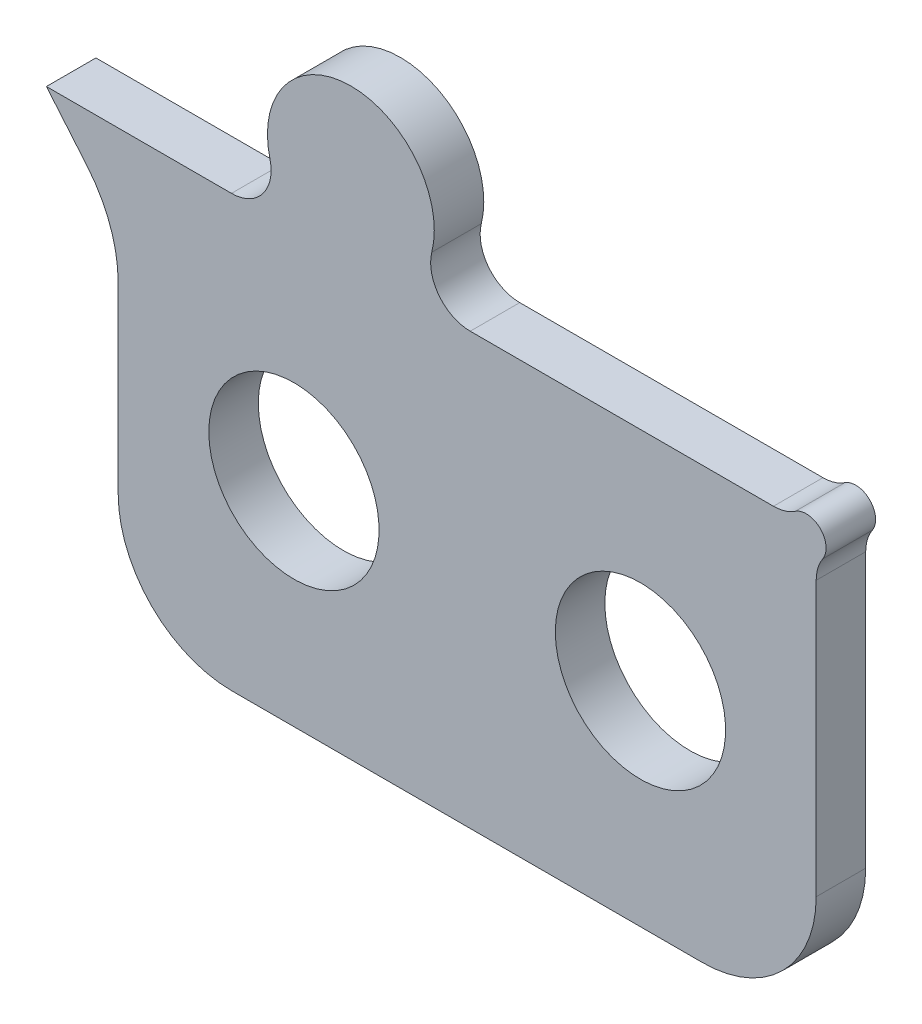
ISO-10303-21;
HEADER;
FILE_DESCRIPTION(('STEP AP214'),'2;1');
FILE_NAME('part.step','',(''),(''),'','','');
FILE_SCHEMA(('AUTOMOTIVE_DESIGN { 1 0 10303 214 1 1 1 1 }'));
ENDSEC;
DATA;
#1=APPLICATION_CONTEXT('core data for automotive mechanical design processes');
#2=APPLICATION_PROTOCOL_DEFINITION('international standard','automotive_design',2000,#1);
#3=PRODUCT_CONTEXT('',#1,'mechanical');
#4=PRODUCT('Part','Part','',(#3));
#5=PRODUCT_RELATED_PRODUCT_CATEGORY('part','',(#4));
#6=PRODUCT_DEFINITION_FORMATION('','',#4);
#7=PRODUCT_DEFINITION_CONTEXT('part definition',#1,'design');
#8=PRODUCT_DEFINITION('design','',#6,#7);
#9=PRODUCT_DEFINITION_SHAPE('','',#8);
#10=(LENGTH_UNIT() NAMED_UNIT(*) SI_UNIT(.MILLI.,.METRE.));
#11=(NAMED_UNIT(*) PLANE_ANGLE_UNIT() SI_UNIT($,.RADIAN.));
#12=(NAMED_UNIT(*) SI_UNIT($,.STERADIAN.) SOLID_ANGLE_UNIT());
#13=UNCERTAINTY_MEASURE_WITH_UNIT(LENGTH_MEASURE(1.E-05),#10,'distance_accuracy_value','');
#14=(GEOMETRIC_REPRESENTATION_CONTEXT(3) GLOBAL_UNCERTAINTY_ASSIGNED_CONTEXT((#13)) GLOBAL_UNIT_ASSIGNED_CONTEXT((#10,
#11,#12)) REPRESENTATION_CONTEXT('',''));
#15=CARTESIAN_POINT('',(0.,0.,0.));
#16=DIRECTION('',(0.,0.,1.));
#17=DIRECTION('',(1.,0.,0.));
#18=AXIS2_PLACEMENT_3D('',#15,#16,#17);
#19=CARTESIAN_POINT('',(-162.306,-88.8003363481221,0.));
#20=DIRECTION('',(0.,0.,1.));
#21=DIRECTION('',(1.,0.,0.));
#22=AXIS2_PLACEMENT_3D('',#19,#20,#21);
#23=PLANE('',#22);
#24=CARTESIAN_POINT('',(-146.431,-93.091,0.));
#25=DIRECTION('',(0.,0.,-1.));
#26=DIRECTION('',(-1.,0.,0.));
#27=AXIS2_PLACEMENT_3D('',#24,#25,#26);
#28=CIRCLE('',#27,4.36880000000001);
#29=CARTESIAN_POINT('',(-150.7998,-93.091,0.));
#30=VERTEX_POINT('',#29);
#31=EDGE_CURVE('E360',#30,#30,#28,.T.);
#32=ORIENTED_EDGE('',*,*,#31,.F.);
#33=EDGE_LOOP('',(#32));
#34=FACE_BOUND('',#33,.T.);
#35=DIRECTION('',(0.642787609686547,-0.766044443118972,0.));
#36=VECTOR('',#35,1.);
#37=CARTESIAN_POINT('',(-159.131,-81.915,0.));
#38=LINE('',#37,#36);
#39=CARTESIAN_POINT('',(-159.131,-81.915,0.));
#40=VERTEX_POINT('',#39);
#41=CARTESIAN_POINT('',(-157.05246720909,-84.3920989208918,0.));
#42=VERTEX_POINT('',#41);
#43=EDGE_CURVE('E190',#40,#42,#38,.T.);
#44=ORIENTED_EDGE('',*,*,#43,.F.);
#45=DIRECTION('',(-1.,0.,0.));
#46=VECTOR('',#45,1.);
#47=CARTESIAN_POINT('',(-149.63515351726,-81.915,0.));
#48=LINE('',#47,#46);
#49=CARTESIAN_POINT('',(-149.63515351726,-81.915,0.));
#50=VERTEX_POINT('',#49);
#51=EDGE_CURVE('E119',#50,#40,#48,.T.);
#52=ORIENTED_EDGE('',*,*,#51,.F.);
#53=CARTESIAN_POINT('',(-149.63515351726,-79.883,0.));
#54=DIRECTION('',(0.,0.,-1.));
#55=DIRECTION('',(1.,0.,0.));
#56=AXIS2_PLACEMENT_3D('',#53,#54,#55);
#57=CIRCLE('',#56,2.032);
#58=CARTESIAN_POINT('',(-147.663273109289,-79.3923762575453,0.));
#59=VERTEX_POINT('',#58);
#60=EDGE_CURVE('E113',#59,#50,#57,.T.);
#61=ORIENTED_EDGE('',*,*,#60,.F.);
#62=CARTESIAN_POINT('',(-143.51,-78.359,0.));
#63=DIRECTION('',(0.,0.,1.));
#64=DIRECTION('',(1.,0.,0.));
#65=AXIS2_PLACEMENT_3D('',#62,#63,#64);
#66=CIRCLE('',#65,4.27989999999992);
#67=CARTESIAN_POINT('',(-139.356726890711,-79.3923762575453,0.));
#68=VERTEX_POINT('',#67);
#69=EDGE_CURVE('E176',#68,#59,#66,.T.);
#70=ORIENTED_EDGE('',*,*,#69,.F.);
#71=CARTESIAN_POINT('',(-137.38484648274,-79.883,0.));
#72=DIRECTION('',(0.,0.,-1.));
#73=DIRECTION('',(1.,0.,0.));
#74=AXIS2_PLACEMENT_3D('',#71,#72,#73);
#75=CIRCLE('',#74,2.03200000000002);
#76=CARTESIAN_POINT('',(-137.38484648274,-81.915,0.));
#77=VERTEX_POINT('',#76);
#78=EDGE_CURVE('E225',#77,#68,#75,.T.);
#79=ORIENTED_EDGE('',*,*,#78,.F.);
#80=DIRECTION('',(-1.,0.,0.));
#81=VECTOR('',#80,1.);
#82=CARTESIAN_POINT('',(-121.826845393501,-81.915,0.));
#83=LINE('',#82,#81);
#84=CARTESIAN_POINT('',(-121.826845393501,-81.915,0.));
#85=VERTEX_POINT('',#84);
#86=EDGE_CURVE('E222',#85,#77,#83,.T.);
#87=ORIENTED_EDGE('',*,*,#86,.F.);
#88=CARTESIAN_POINT('',(-121.826845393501,-79.883,0.));
#89=DIRECTION('',(0.,0.,-1.));
#90=DIRECTION('',(1.,0.,0.));
#91=AXIS2_PLACEMENT_3D('',#88,#89,#90);
#92=CIRCLE('',#91,2.032);
#93=CARTESIAN_POINT('',(-120.703615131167,-81.5763333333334,0.));
#94=VERTEX_POINT('',#93);
#95=EDGE_CURVE('E219',#94,#85,#92,.T.);
#96=ORIENTED_EDGE('',*,*,#95,.F.);
#97=CARTESIAN_POINT('',(-120.142,-82.423,0.));
#98=DIRECTION('',(0.,0.,1.));
#99=DIRECTION('',(1.,0.,0.));
#100=AXIS2_PLACEMENT_3D('',#97,#98,#99);
#101=CIRCLE('',#100,1.01599999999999);
#102=CARTESIAN_POINT('',(-119.295333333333,-82.9846151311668,0.));
#103=VERTEX_POINT('',#102);
#104=EDGE_CURVE('E216',#103,#94,#101,.T.);
#105=ORIENTED_EDGE('',*,*,#104,.F.);
#106=CARTESIAN_POINT('',(-117.602,-84.1078453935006,0.));
#107=DIRECTION('',(0.,0.,-1.));
#108=DIRECTION('',(1.,0.,0.));
#109=AXIS2_PLACEMENT_3D('',#106,#107,#108);
#110=CIRCLE('',#109,2.032);
#111=CARTESIAN_POINT('',(-119.634,-84.1078453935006,0.));
#112=VERTEX_POINT('',#111);
#113=EDGE_CURVE('E213',#112,#103,#110,.T.);
#114=ORIENTED_EDGE('',*,*,#113,.F.);
#115=DIRECTION('',(0.,1.,0.));
#116=VECTOR('',#115,1.);
#117=CARTESIAN_POINT('',(-119.634,-98.171,0.));
#118=LINE('',#117,#116);
#119=CARTESIAN_POINT('',(-119.634,-98.171,0.));
#120=VERTEX_POINT('',#119);
#121=EDGE_CURVE('E210',#120,#112,#118,.T.);
#122=ORIENTED_EDGE('',*,*,#121,.F.);
#123=CARTESIAN_POINT('',(-125.476,-98.171,0.));
#124=DIRECTION('',(0.,0.,1.));
#125=DIRECTION('',(1.,0.,0.));
#126=AXIS2_PLACEMENT_3D('',#123,#124,#125);
#127=CIRCLE('',#126,5.84199999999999);
#128=CARTESIAN_POINT('',(-125.476,-104.013,0.));
#129=VERTEX_POINT('',#128);
#130=EDGE_CURVE('E207',#129,#120,#127,.T.);
#131=ORIENTED_EDGE('',*,*,#130,.F.);
#132=DIRECTION('',(1.,0.,0.));
#133=VECTOR('',#132,1.);
#134=CARTESIAN_POINT('',(-149.606,-104.013,0.));
#135=LINE('',#134,#133);
#136=CARTESIAN_POINT('',(-149.606,-104.013,0.));
#137=VERTEX_POINT('',#136);
#138=EDGE_CURVE('E204',#137,#129,#135,.T.);
#139=ORIENTED_EDGE('',*,*,#138,.F.);
#140=CARTESIAN_POINT('',(-149.606,-98.171,0.));
#141=DIRECTION('',(0.,0.,1.));
#142=DIRECTION('',(1.,0.,0.));
#143=AXIS2_PLACEMENT_3D('',#140,#141,#142);
#144=CIRCLE('',#143,5.84199999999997);
#145=CARTESIAN_POINT('',(-155.448,-98.171,0.));
#146=VERTEX_POINT('',#145);
#147=EDGE_CURVE('E201',#146,#137,#144,.T.);
#148=ORIENTED_EDGE('',*,*,#147,.F.);
#149=DIRECTION('',(0.,-1.,0.));
#150=VECTOR('',#149,1.);
#151=CARTESIAN_POINT('',(-155.448,-88.8003363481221,0.));
#152=LINE('',#151,#150);
#153=CARTESIAN_POINT('',(-155.448,-88.8003363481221,0.));
#154=VERTEX_POINT('',#153);
#155=EDGE_CURVE('E198',#154,#146,#152,.T.);
#156=ORIENTED_EDGE('',*,*,#155,.F.);
#157=CARTESIAN_POINT('',(-162.306,-88.8003363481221,0.));
#158=DIRECTION('',(0.,0.,-1.));
#159=DIRECTION('',(1.,0.,0.));
#160=AXIS2_PLACEMENT_3D('',#157,#158,#159);
#161=CIRCLE('',#160,6.85800000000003);
#162=EDGE_CURVE('E194',#42,#154,#161,.T.);
#163=ORIENTED_EDGE('',*,*,#162,.F.);
#164=EDGE_LOOP('',(#44,#52,#61,#70,#79,#87,#96,#105,#114,#122,#131,#139,#148,#156,#163));
#165=FACE_BOUND('',#164,.T.);
#166=CARTESIAN_POINT('',(-128.651,-93.091,0.));
#167=DIRECTION('',(0.,0.,-1.));
#168=DIRECTION('',(-1.,0.,0.));
#169=AXIS2_PLACEMENT_3D('',#166,#167,#168);
#170=CIRCLE('',#169,4.36879999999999);
#171=CARTESIAN_POINT('',(-133.0198,-93.091,0.));
#172=VERTEX_POINT('',#171);
#173=EDGE_CURVE('E350',#172,#172,#170,.T.);
#174=ORIENTED_EDGE('',*,*,#173,.F.);
#175=EDGE_LOOP('',(#174));
#176=FACE_BOUND('',#175,.T.);
#177=ADVANCED_FACE('F45',(#34,#165,#176),#23,.F.);
#178=CARTESIAN_POINT('',(-159.131,-81.915,2.54));
#179=DIRECTION('',(0.766044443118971,0.642787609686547,0.));
#180=DIRECTION('',(-0.642787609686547,0.766044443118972,0.));
#181=AXIS2_PLACEMENT_3D('',#178,#179,#180);
#182=PLANE('',#181);
#183=ORIENTED_EDGE('',*,*,#43,.T.);
#184=DIRECTION('',(0.,0.,-1.));
#185=VECTOR('',#184,1.);
#186=CARTESIAN_POINT('',(-157.05246720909,-84.3920989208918,2.54));
#187=LINE('',#186,#185);
#188=CARTESIAN_POINT('',(-157.05246720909,-84.3920989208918,2.54));
#189=VERTEX_POINT('',#188);
#190=EDGE_CURVE('E11',#189,#42,#187,.T.);
#191=ORIENTED_EDGE('',*,*,#190,.F.);
#192=DIRECTION('',(0.642787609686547,-0.766044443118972,0.));
#193=VECTOR('',#192,1.);
#194=CARTESIAN_POINT('',(-159.131,-81.915,2.54));
#195=LINE('',#194,#193);
#196=CARTESIAN_POINT('',(-159.131,-81.915,2.54));
#197=VERTEX_POINT('',#196);
#198=EDGE_CURVE('E234',#197,#189,#195,.T.);
#199=ORIENTED_EDGE('',*,*,#198,.F.);
#200=DIRECTION('',(0.,0.,-1.));
#201=VECTOR('',#200,1.);
#202=CARTESIAN_POINT('',(-159.131,-81.915,2.54));
#203=LINE('',#202,#201);
#204=EDGE_CURVE('E186',#197,#40,#203,.T.);
#205=ORIENTED_EDGE('',*,*,#204,.T.);
#206=EDGE_LOOP('',(#183,#191,#199,#205));
#207=FACE_BOUND('',#206,.T.);
#208=ADVANCED_FACE('F47',(#207),#182,.F.);
#209=CARTESIAN_POINT('',(-162.306,-88.8003363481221,2.54));
#210=DIRECTION('',(0.,0.,-1.));
#211=DIRECTION('',(-1.,0.,0.));
#212=AXIS2_PLACEMENT_3D('',#209,#210,#211);
#213=CYLINDRICAL_SURFACE('',#212,6.85800000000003);
#214=ORIENTED_EDGE('',*,*,#162,.T.);
#215=DIRECTION('',(0.,0.,-1.));
#216=VECTOR('',#215,1.);
#217=CARTESIAN_POINT('',(-155.448,-88.8003363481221,2.54));
#218=LINE('',#217,#216);
#219=CARTESIAN_POINT('',(-155.448,-88.8003363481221,2.54));
#220=VERTEX_POINT('',#219);
#221=EDGE_CURVE('E55',#220,#154,#218,.T.);
#222=ORIENTED_EDGE('',*,*,#221,.F.);
#223=CARTESIAN_POINT('',(-162.306,-88.8003363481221,2.54));
#224=DIRECTION('',(0.,0.,-1.));
#225=DIRECTION('',(1.,0.,0.));
#226=AXIS2_PLACEMENT_3D('',#223,#224,#225);
#227=CIRCLE('',#226,6.85800000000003);
#228=EDGE_CURVE('E127',#189,#220,#227,.T.);
#229=ORIENTED_EDGE('',*,*,#228,.F.);
#230=ORIENTED_EDGE('',*,*,#190,.T.);
#231=EDGE_LOOP('',(#214,#222,#229,#230));
#232=FACE_BOUND('',#231,.T.);
#233=ADVANCED_FACE('F377',(#232),#213,.F.);
#234=CARTESIAN_POINT('',(-155.448,-88.8003363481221,2.54));
#235=DIRECTION('',(1.,0.,0.));
#236=DIRECTION('',(0.,0.,-1.));
#237=AXIS2_PLACEMENT_3D('',#234,#235,#236);
#238=PLANE('',#237);
#239=ORIENTED_EDGE('',*,*,#155,.T.);
#240=DIRECTION('',(0.,0.,-1.));
#241=VECTOR('',#240,1.);
#242=CARTESIAN_POINT('',(-155.448,-98.171,2.54));
#243=LINE('',#242,#241);
#244=CARTESIAN_POINT('',(-155.448,-98.171,2.54));
#245=VERTEX_POINT('',#244);
#246=EDGE_CURVE('E273',#245,#146,#243,.T.);
#247=ORIENTED_EDGE('',*,*,#246,.F.);
#248=DIRECTION('',(0.,-1.,0.));
#249=VECTOR('',#248,1.);
#250=CARTESIAN_POINT('',(-155.448,-88.8003363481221,2.54));
#251=LINE('',#250,#249);
#252=EDGE_CURVE('E284',#220,#245,#251,.T.);
#253=ORIENTED_EDGE('',*,*,#252,.F.);
#254=ORIENTED_EDGE('',*,*,#221,.T.);
#255=EDGE_LOOP('',(#239,#247,#253,#254));
#256=FACE_BOUND('',#255,.T.);
#257=ADVANCED_FACE('F282',(#256),#238,.F.);
#258=CARTESIAN_POINT('',(-149.606,-98.171,2.54));
#259=DIRECTION('',(0.,0.,-1.));
#260=DIRECTION('',(-1.,0.,0.));
#261=AXIS2_PLACEMENT_3D('',#258,#259,#260);
#262=CYLINDRICAL_SURFACE('',#261,5.84199999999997);
#263=ORIENTED_EDGE('',*,*,#147,.T.);
#264=DIRECTION('',(0.,0.,-1.));
#265=VECTOR('',#264,1.);
#266=CARTESIAN_POINT('',(-149.606,-104.013,2.54));
#267=LINE('',#266,#265);
#268=CARTESIAN_POINT('',(-149.606,-104.013,2.54));
#269=VERTEX_POINT('',#268);
#270=EDGE_CURVE('E269',#269,#137,#267,.T.);
#271=ORIENTED_EDGE('',*,*,#270,.F.);
#272=CARTESIAN_POINT('',(-149.606,-98.171,2.54));
#273=DIRECTION('',(0.,0.,1.));
#274=DIRECTION('',(1.,0.,0.));
#275=AXIS2_PLACEMENT_3D('',#272,#273,#274);
#276=CIRCLE('',#275,5.84199999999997);
#277=EDGE_CURVE('E303',#245,#269,#276,.T.);
#278=ORIENTED_EDGE('',*,*,#277,.F.);
#279=ORIENTED_EDGE('',*,*,#246,.T.);
#280=EDGE_LOOP('',(#263,#271,#278,#279));
#281=FACE_BOUND('',#280,.T.);
#282=ADVANCED_FACE('F293',(#281),#262,.T.);
#283=CARTESIAN_POINT('',(-149.606,-104.013,2.54));
#284=DIRECTION('',(0.,1.,0.));
#285=DIRECTION('',(-1.,0.,0.));
#286=AXIS2_PLACEMENT_3D('',#283,#284,#285);
#287=PLANE('',#286);
#288=ORIENTED_EDGE('',*,*,#138,.T.);
#289=DIRECTION('',(0.,0.,-1.));
#290=VECTOR('',#289,1.);
#291=CARTESIAN_POINT('',(-125.476,-104.013,2.54));
#292=LINE('',#291,#290);
#293=CARTESIAN_POINT('',(-125.476,-104.013,2.54));
#294=VERTEX_POINT('',#293);
#295=EDGE_CURVE('E265',#294,#129,#292,.T.);
#296=ORIENTED_EDGE('',*,*,#295,.F.);
#297=DIRECTION('',(1.,0.,0.));
#298=VECTOR('',#297,1.);
#299=CARTESIAN_POINT('',(-149.606,-104.013,2.54));
#300=LINE('',#299,#298);
#301=EDGE_CURVE('E299',#269,#294,#300,.T.);
#302=ORIENTED_EDGE('',*,*,#301,.F.);
#303=ORIENTED_EDGE('',*,*,#270,.T.);
#304=EDGE_LOOP('',(#288,#296,#302,#303));
#305=FACE_BOUND('',#304,.T.);
#306=ADVANCED_FACE('F297',(#305),#287,.F.);
#307=CARTESIAN_POINT('',(-125.476,-98.171,2.54));
#308=DIRECTION('',(0.,0.,-1.));
#309=DIRECTION('',(-1.,0.,0.));
#310=AXIS2_PLACEMENT_3D('',#307,#308,#309);
#311=CYLINDRICAL_SURFACE('',#310,5.84199999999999);
#312=ORIENTED_EDGE('',*,*,#130,.T.);
#313=DIRECTION('',(0.,0.,-1.));
#314=VECTOR('',#313,1.);
#315=CARTESIAN_POINT('',(-119.634,-98.171,2.54));
#316=LINE('',#315,#314);
#317=CARTESIAN_POINT('',(-119.634,-98.171,2.54));
#318=VERTEX_POINT('',#317);
#319=EDGE_CURVE('E261',#318,#120,#316,.T.);
#320=ORIENTED_EDGE('',*,*,#319,.F.);
#321=CARTESIAN_POINT('',(-125.476,-98.171,2.54));
#322=DIRECTION('',(0.,0.,1.));
#323=DIRECTION('',(1.,0.,0.));
#324=AXIS2_PLACEMENT_3D('',#321,#322,#323);
#325=CIRCLE('',#324,5.84199999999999);
#326=EDGE_CURVE('E302',#294,#318,#325,.T.);
#327=ORIENTED_EDGE('',*,*,#326,.F.);
#328=ORIENTED_EDGE('',*,*,#295,.T.);
#329=EDGE_LOOP('',(#312,#320,#327,#328));
#330=FACE_BOUND('',#329,.T.);
#331=ADVANCED_FACE('F422',(#330),#311,.T.);
#332=CARTESIAN_POINT('',(-119.634,-98.171,2.54));
#333=DIRECTION('',(-1.,0.,0.));
#334=DIRECTION('',(0.,0.,1.));
#335=AXIS2_PLACEMENT_3D('',#332,#333,#334);
#336=PLANE('',#335);
#337=ORIENTED_EDGE('',*,*,#121,.T.);
#338=DIRECTION('',(0.,0.,-1.));
#339=VECTOR('',#338,1.);
#340=CARTESIAN_POINT('',(-119.634,-84.1078453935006,2.54));
#341=LINE('',#340,#339);
#342=CARTESIAN_POINT('',(-119.634,-84.1078453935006,2.54));
#343=VERTEX_POINT('',#342);
#344=EDGE_CURVE('E257',#343,#112,#341,.T.);
#345=ORIENTED_EDGE('',*,*,#344,.F.);
#346=DIRECTION('',(0.,1.,0.));
#347=VECTOR('',#346,1.);
#348=CARTESIAN_POINT('',(-119.634,-98.171,2.54));
#349=LINE('',#348,#347);
#350=EDGE_CURVE('E308',#318,#343,#349,.T.);
#351=ORIENTED_EDGE('',*,*,#350,.F.);
#352=ORIENTED_EDGE('',*,*,#319,.T.);
#353=EDGE_LOOP('',(#337,#345,#351,#352));
#354=FACE_BOUND('',#353,.T.);
#355=ADVANCED_FACE('F418',(#354),#336,.F.);
#356=CARTESIAN_POINT('',(-117.602,-84.1078453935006,2.54));
#357=DIRECTION('',(0.,0.,-1.));
#358=DIRECTION('',(-1.,0.,0.));
#359=AXIS2_PLACEMENT_3D('',#356,#357,#358);
#360=CYLINDRICAL_SURFACE('',#359,2.032);
#361=ORIENTED_EDGE('',*,*,#113,.T.);
#362=DIRECTION('',(0.,0.,-1.));
#363=VECTOR('',#362,1.);
#364=CARTESIAN_POINT('',(-119.295333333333,-82.9846151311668,2.54));
#365=LINE('',#364,#363);
#366=CARTESIAN_POINT('',(-119.295333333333,-82.9846151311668,2.54));
#367=VERTEX_POINT('',#366);
#368=EDGE_CURVE('E253',#367,#103,#365,.T.);
#369=ORIENTED_EDGE('',*,*,#368,.F.);
#370=CARTESIAN_POINT('',(-117.602,-84.1078453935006,2.54));
#371=DIRECTION('',(0.,0.,-1.));
#372=DIRECTION('',(1.,0.,0.));
#373=AXIS2_PLACEMENT_3D('',#370,#371,#372);
#374=CIRCLE('',#373,2.032);
#375=EDGE_CURVE('E315',#343,#367,#374,.T.);
#376=ORIENTED_EDGE('',*,*,#375,.F.);
#377=ORIENTED_EDGE('',*,*,#344,.T.);
#378=EDGE_LOOP('',(#361,#369,#376,#377));
#379=FACE_BOUND('',#378,.T.);
#380=ADVANCED_FACE('F414',(#379),#360,.F.);
#381=CARTESIAN_POINT('',(-120.142,-82.423,2.54));
#382=DIRECTION('',(0.,0.,-1.));
#383=DIRECTION('',(-1.,0.,0.));
#384=AXIS2_PLACEMENT_3D('',#381,#382,#383);
#385=CYLINDRICAL_SURFACE('',#384,1.01599999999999);
#386=ORIENTED_EDGE('',*,*,#104,.T.);
#387=DIRECTION('',(0.,0.,-1.));
#388=VECTOR('',#387,1.);
#389=CARTESIAN_POINT('',(-120.703615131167,-81.5763333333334,2.54));
#390=LINE('',#389,#388);
#391=CARTESIAN_POINT('',(-120.703615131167,-81.5763333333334,2.54));
#392=VERTEX_POINT('',#391);
#393=EDGE_CURVE('E249',#392,#94,#390,.T.);
#394=ORIENTED_EDGE('',*,*,#393,.F.);
#395=CARTESIAN_POINT('',(-120.142,-82.423,2.54));
#396=DIRECTION('',(0.,0.,1.));
#397=DIRECTION('',(1.,0.,0.));
#398=AXIS2_PLACEMENT_3D('',#395,#396,#397);
#399=CIRCLE('',#398,1.01599999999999);
#400=EDGE_CURVE('E318',#367,#392,#399,.T.);
#401=ORIENTED_EDGE('',*,*,#400,.F.);
#402=ORIENTED_EDGE('',*,*,#368,.T.);
#403=EDGE_LOOP('',(#386,#394,#401,#402));
#404=FACE_BOUND('',#403,.T.);
#405=ADVANCED_FACE('F410',(#404),#385,.T.);
#406=CARTESIAN_POINT('',(-121.826845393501,-79.883,2.54));
#407=DIRECTION('',(0.,0.,-1.));
#408=DIRECTION('',(-1.,0.,0.));
#409=AXIS2_PLACEMENT_3D('',#406,#407,#408);
#410=CYLINDRICAL_SURFACE('',#409,2.032);
#411=ORIENTED_EDGE('',*,*,#95,.T.);
#412=DIRECTION('',(0.,0.,-1.));
#413=VECTOR('',#412,1.);
#414=CARTESIAN_POINT('',(-121.826845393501,-81.915,2.54));
#415=LINE('',#414,#413);
#416=CARTESIAN_POINT('',(-121.826845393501,-81.915,2.54));
#417=VERTEX_POINT('',#416);
#418=EDGE_CURVE('E245',#417,#85,#415,.T.);
#419=ORIENTED_EDGE('',*,*,#418,.F.);
#420=CARTESIAN_POINT('',(-121.826845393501,-79.883,2.54));
#421=DIRECTION('',(0.,0.,-1.));
#422=DIRECTION('',(1.,0.,0.));
#423=AXIS2_PLACEMENT_3D('',#420,#421,#422);
#424=CIRCLE('',#423,2.032);
#425=EDGE_CURVE('E321',#392,#417,#424,.T.);
#426=ORIENTED_EDGE('',*,*,#425,.F.);
#427=ORIENTED_EDGE('',*,*,#393,.T.);
#428=EDGE_LOOP('',(#411,#419,#426,#427));
#429=FACE_BOUND('',#428,.T.);
#430=ADVANCED_FACE('F406',(#429),#410,.F.);
#431=CARTESIAN_POINT('',(-121.826845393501,-81.915,2.54));
#432=DIRECTION('',(0.,-1.,0.));
#433=DIRECTION('',(1.,0.,0.));
#434=AXIS2_PLACEMENT_3D('',#431,#432,#433);
#435=PLANE('',#434);
#436=ORIENTED_EDGE('',*,*,#86,.T.);
#437=DIRECTION('',(0.,0.,-1.));
#438=VECTOR('',#437,1.);
#439=CARTESIAN_POINT('',(-137.38484648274,-81.915,2.54));
#440=LINE('',#439,#438);
#441=CARTESIAN_POINT('',(-137.38484648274,-81.915,2.54));
#442=VERTEX_POINT('',#441);
#443=EDGE_CURVE('E241',#442,#77,#440,.T.);
#444=ORIENTED_EDGE('',*,*,#443,.F.);
#445=DIRECTION('',(-1.,0.,0.));
#446=VECTOR('',#445,1.);
#447=CARTESIAN_POINT('',(-121.826845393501,-81.915,2.54));
#448=LINE('',#447,#446);
#449=EDGE_CURVE('E324',#417,#442,#448,.T.);
#450=ORIENTED_EDGE('',*,*,#449,.F.);
#451=ORIENTED_EDGE('',*,*,#418,.T.);
#452=EDGE_LOOP('',(#436,#444,#450,#451));
#453=FACE_BOUND('',#452,.T.);
#454=ADVANCED_FACE('F402',(#453),#435,.F.);
#455=CARTESIAN_POINT('',(-137.38484648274,-79.883,2.54));
#456=DIRECTION('',(0.,0.,-1.));
#457=DIRECTION('',(-1.,0.,0.));
#458=AXIS2_PLACEMENT_3D('',#455,#456,#457);
#459=CYLINDRICAL_SURFACE('',#458,2.03200000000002);
#460=ORIENTED_EDGE('',*,*,#78,.T.);
#461=DIRECTION('',(0.,0.,-1.));
#462=VECTOR('',#461,1.);
#463=CARTESIAN_POINT('',(-139.356726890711,-79.3923762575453,2.54));
#464=LINE('',#463,#462);
#465=CARTESIAN_POINT('',(-139.356726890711,-79.3923762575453,2.54));
#466=VERTEX_POINT('',#465);
#467=EDGE_CURVE('E178',#466,#68,#464,.T.);
#468=ORIENTED_EDGE('',*,*,#467,.F.);
#469=CARTESIAN_POINT('',(-137.38484648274,-79.883,2.54));
#470=DIRECTION('',(0.,0.,-1.));
#471=DIRECTION('',(1.,0.,0.));
#472=AXIS2_PLACEMENT_3D('',#469,#470,#471);
#473=CIRCLE('',#472,2.03200000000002);
#474=EDGE_CURVE('E167',#442,#466,#473,.T.);
#475=ORIENTED_EDGE('',*,*,#474,.F.);
#476=ORIENTED_EDGE('',*,*,#443,.T.);
#477=EDGE_LOOP('',(#460,#468,#475,#476));
#478=FACE_BOUND('',#477,.T.);
#479=ADVANCED_FACE('F399',(#478),#459,.F.);
#480=CARTESIAN_POINT('',(-143.51,-78.359,2.54));
#481=DIRECTION('',(0.,0.,-1.));
#482=DIRECTION('',(-1.,0.,0.));
#483=AXIS2_PLACEMENT_3D('',#480,#481,#482);
#484=CYLINDRICAL_SURFACE('',#483,4.27989999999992);
#485=ORIENTED_EDGE('',*,*,#69,.T.);
#486=DIRECTION('',(0.,0.,-1.));
#487=VECTOR('',#486,1.);
#488=CARTESIAN_POINT('',(-147.663273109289,-79.3923762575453,2.54));
#489=LINE('',#488,#487);
#490=CARTESIAN_POINT('',(-147.663273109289,-79.3923762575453,2.54));
#491=VERTEX_POINT('',#490);
#492=EDGE_CURVE('E173',#491,#59,#489,.T.);
#493=ORIENTED_EDGE('',*,*,#492,.F.);
#494=CARTESIAN_POINT('',(-143.51,-78.359,2.54));
#495=DIRECTION('',(0.,0.,1.));
#496=DIRECTION('',(1.,0.,0.));
#497=AXIS2_PLACEMENT_3D('',#494,#495,#496);
#498=CIRCLE('',#497,4.27989999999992);
#499=EDGE_CURVE('E161',#466,#491,#498,.T.);
#500=ORIENTED_EDGE('',*,*,#499,.F.);
#501=ORIENTED_EDGE('',*,*,#467,.T.);
#502=EDGE_LOOP('',(#485,#493,#500,#501));
#503=FACE_BOUND('',#502,.T.);
#504=ADVANCED_FACE('F174',(#503),#484,.T.);
#505=CARTESIAN_POINT('',(-149.63515351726,-79.883,2.54));
#506=DIRECTION('',(0.,0.,-1.));
#507=DIRECTION('',(-1.,0.,0.));
#508=AXIS2_PLACEMENT_3D('',#505,#506,#507);
#509=CYLINDRICAL_SURFACE('',#508,2.032);
#510=ORIENTED_EDGE('',*,*,#60,.T.);
#511=DIRECTION('',(0.,0.,-1.));
#512=VECTOR('',#511,1.);
#513=CARTESIAN_POINT('',(-149.63515351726,-81.915,2.54));
#514=LINE('',#513,#512);
#515=CARTESIAN_POINT('',(-149.63515351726,-81.915,2.54));
#516=VERTEX_POINT('',#515);
#517=EDGE_CURVE('E179',#516,#50,#514,.T.);
#518=ORIENTED_EDGE('',*,*,#517,.F.);
#519=CARTESIAN_POINT('',(-149.63515351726,-79.883,2.54));
#520=DIRECTION('',(0.,0.,-1.));
#521=DIRECTION('',(1.,0.,0.));
#522=AXIS2_PLACEMENT_3D('',#519,#520,#521);
#523=CIRCLE('',#522,2.032);
#524=EDGE_CURVE('E165',#491,#516,#523,.T.);
#525=ORIENTED_EDGE('',*,*,#524,.F.);
#526=ORIENTED_EDGE('',*,*,#492,.T.);
#527=EDGE_LOOP('',(#510,#518,#525,#526));
#528=FACE_BOUND('',#527,.T.);
#529=ADVANCED_FACE('F181',(#528),#509,.F.);
#530=CARTESIAN_POINT('',(-149.63515351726,-81.915,2.54));
#531=DIRECTION('',(0.,-1.,0.));
#532=DIRECTION('',(1.,0.,0.));
#533=AXIS2_PLACEMENT_3D('',#530,#531,#532);
#534=PLANE('',#533);
#535=ORIENTED_EDGE('',*,*,#51,.T.);
#536=ORIENTED_EDGE('',*,*,#204,.F.);
#537=DIRECTION('',(-1.,0.,0.));
#538=VECTOR('',#537,1.);
#539=CARTESIAN_POINT('',(-149.63515351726,-81.915,2.54));
#540=LINE('',#539,#538);
#541=EDGE_CURVE('E63',#516,#197,#540,.T.);
#542=ORIENTED_EDGE('',*,*,#541,.F.);
#543=ORIENTED_EDGE('',*,*,#517,.T.);
#544=EDGE_LOOP('',(#535,#536,#542,#543));
#545=FACE_BOUND('',#544,.T.);
#546=ADVANCED_FACE('F392',(#545),#534,.F.);
#547=CARTESIAN_POINT('',(-162.306,-88.8003363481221,2.54));
#548=DIRECTION('',(0.,0.,1.));
#549=DIRECTION('',(1.,0.,0.));
#550=AXIS2_PLACEMENT_3D('',#547,#548,#549);
#551=PLANE('',#550);
#552=CARTESIAN_POINT('',(-146.431,-93.091,2.54));
#553=DIRECTION('',(0.,0.,-1.));
#554=DIRECTION('',(-1.,0.,0.));
#555=AXIS2_PLACEMENT_3D('',#552,#553,#554);
#556=CIRCLE('',#555,4.36880000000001);
#557=CARTESIAN_POINT('',(-150.7998,-93.091,2.54));
#558=VERTEX_POINT('',#557);
#559=EDGE_CURVE('E355',#558,#558,#556,.T.);
#560=ORIENTED_EDGE('',*,*,#559,.T.);
#561=EDGE_LOOP('',(#560));
#562=FACE_BOUND('',#561,.T.);
#563=CARTESIAN_POINT('',(-128.651,-93.091,2.54));
#564=DIRECTION('',(0.,0.,-1.));
#565=DIRECTION('',(-1.,0.,0.));
#566=AXIS2_PLACEMENT_3D('',#563,#564,#565);
#567=CIRCLE('',#566,4.36879999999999);
#568=CARTESIAN_POINT('',(-133.0198,-93.091,2.54));
#569=VERTEX_POINT('',#568);
#570=EDGE_CURVE('E195',#569,#569,#567,.T.);
#571=ORIENTED_EDGE('',*,*,#570,.T.);
#572=EDGE_LOOP('',(#571));
#573=FACE_BOUND('',#572,.T.);
#574=ORIENTED_EDGE('',*,*,#198,.T.);
#575=ORIENTED_EDGE('',*,*,#228,.T.);
#576=ORIENTED_EDGE('',*,*,#252,.T.);
#577=ORIENTED_EDGE('',*,*,#277,.T.);
#578=ORIENTED_EDGE('',*,*,#301,.T.);
#579=ORIENTED_EDGE('',*,*,#326,.T.);
#580=ORIENTED_EDGE('',*,*,#350,.T.);
#581=ORIENTED_EDGE('',*,*,#375,.T.);
#582=ORIENTED_EDGE('',*,*,#400,.T.);
#583=ORIENTED_EDGE('',*,*,#425,.T.);
#584=ORIENTED_EDGE('',*,*,#449,.T.);
#585=ORIENTED_EDGE('',*,*,#474,.T.);
#586=ORIENTED_EDGE('',*,*,#499,.T.);
#587=ORIENTED_EDGE('',*,*,#524,.T.);
#588=ORIENTED_EDGE('',*,*,#541,.T.);
#589=EDGE_LOOP('',(#574,#575,#576,#577,#578,#579,#580,#581,#582,#583,#584,#585,#586,#587,#588));
#590=FACE_BOUND('',#589,.T.);
#591=ADVANCED_FACE('F163',(#562,#573,#590),#551,.T.);
#592=CARTESIAN_POINT('',(-128.651,-93.091,0.));
#593=DIRECTION('',(0.,0.,-1.));
#594=DIRECTION('',(-1.,0.,0.));
#595=AXIS2_PLACEMENT_3D('',#592,#593,#594);
#596=CYLINDRICAL_SURFACE('',#595,4.36879999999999);
#597=ORIENTED_EDGE('',*,*,#570,.F.);
#598=EDGE_LOOP('',(#597));
#599=FACE_BOUND('',#598,.T.);
#600=ORIENTED_EDGE('',*,*,#173,.T.);
#601=EDGE_LOOP('',(#600));
#602=FACE_BOUND('',#601,.T.);
#603=ADVANCED_FACE('F496',(#599,#602),#596,.F.);
#604=CARTESIAN_POINT('',(-146.431,-93.091,0.));
#605=DIRECTION('',(0.,0.,-1.));
#606=DIRECTION('',(-1.,0.,0.));
#607=AXIS2_PLACEMENT_3D('',#604,#605,#606);
#608=CYLINDRICAL_SURFACE('',#607,4.36880000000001);
#609=ORIENTED_EDGE('',*,*,#559,.F.);
#610=EDGE_LOOP('',(#609));
#611=FACE_BOUND('',#610,.T.);
#612=ORIENTED_EDGE('',*,*,#31,.T.);
#613=EDGE_LOOP('',(#612));
#614=FACE_BOUND('',#613,.T.);
#615=ADVANCED_FACE('F505',(#611,#614),#608,.F.);
#616=CLOSED_SHELL('',(#177,#208,#233,#257,#282,#306,#331,#355,#380,#405,#430,#454,#479,#504,
#529,#546,#591,#603,#615));
#617=MANIFOLD_SOLID_BREP('B2',#616);
#618=ADVANCED_BREP_SHAPE_REPRESENTATION('',(#18,#617),#14);
#619=SHAPE_DEFINITION_REPRESENTATION(#9,#618);
ENDSEC;
END-ISO-10303-21;
